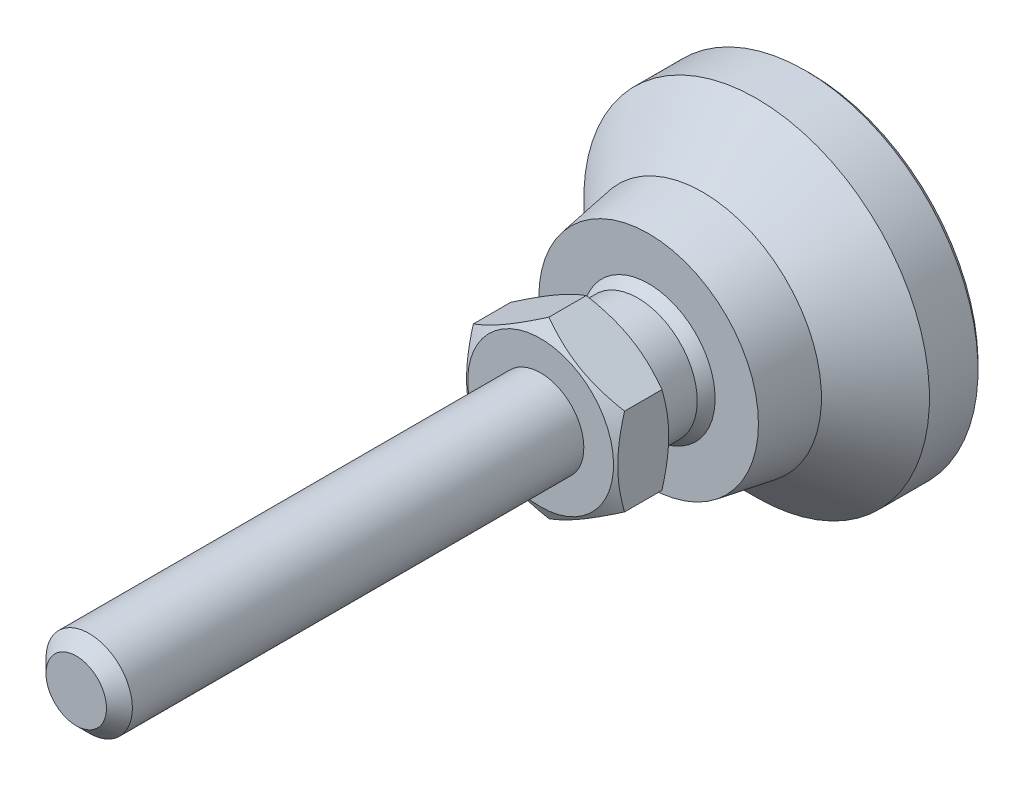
ISO-10303-21;
HEADER;
FILE_DESCRIPTION(('STEP AP214'),'2;1');
FILE_NAME('part.step','',(''),(''),'','','');
FILE_SCHEMA(('AUTOMOTIVE_DESIGN { 1 0 10303 214 1 1 1 1 }'));
ENDSEC;
DATA;
#1=APPLICATION_CONTEXT('core data for automotive mechanical design processes');
#2=APPLICATION_PROTOCOL_DEFINITION('international standard','automotive_design',2000,#1);
#3=PRODUCT_CONTEXT('',#1,'mechanical');
#4=PRODUCT('Part','Part','',(#3));
#5=PRODUCT_RELATED_PRODUCT_CATEGORY('part','',(#4));
#6=PRODUCT_DEFINITION_FORMATION('','',#4);
#7=PRODUCT_DEFINITION_CONTEXT('part definition',#1,'design');
#8=PRODUCT_DEFINITION('design','',#6,#7);
#9=PRODUCT_DEFINITION_SHAPE('','',#8);
#10=(LENGTH_UNIT() NAMED_UNIT(*) SI_UNIT(.MILLI.,.METRE.));
#11=(NAMED_UNIT(*) PLANE_ANGLE_UNIT() SI_UNIT($,.RADIAN.));
#12=(NAMED_UNIT(*) SI_UNIT($,.STERADIAN.) SOLID_ANGLE_UNIT());
#13=UNCERTAINTY_MEASURE_WITH_UNIT(LENGTH_MEASURE(1.E-05),#10,'distance_accuracy_value','');
#14=(GEOMETRIC_REPRESENTATION_CONTEXT(3) GLOBAL_UNCERTAINTY_ASSIGNED_CONTEXT((#13)) GLOBAL_UNIT_ASSIGNED_CONTEXT((#10,
#11,#12)) REPRESENTATION_CONTEXT('',''));
#15=CARTESIAN_POINT('',(0.,0.,0.));
#16=DIRECTION('',(0.,0.,1.));
#17=DIRECTION('',(1.,0.,0.));
#18=AXIS2_PLACEMENT_3D('',#15,#16,#17);
#19=CARTESIAN_POINT('',(0.,0.,0.));
#20=DIRECTION('',(0.,0.,-1.));
#21=DIRECTION('',(0.,1.,0.));
#22=AXIS2_PLACEMENT_3D('',#19,#20,#21);
#23=CYLINDRICAL_SURFACE('',#22,5.49999999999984);
#24=CARTESIAN_POINT('',(0.,0.,20.));
#25=DIRECTION('',(0.,0.,-1.));
#26=DIRECTION('',(0.,1.,0.));
#27=AXIS2_PLACEMENT_3D('',#24,#25,#26);
#28=CIRCLE('',#27,5.49999999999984);
#29=CARTESIAN_POINT('',(0.,5.49999999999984,20.));
#30=VERTEX_POINT('',#29);
#31=EDGE_CURVE('E111',#30,#30,#28,.T.);
#32=ORIENTED_EDGE('',*,*,#31,.T.);
#33=EDGE_LOOP('',(#32));
#34=FACE_BOUND('',#33,.T.);
#35=CARTESIAN_POINT('',(0.,0.,16.0000000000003));
#36=DIRECTION('',(0.,0.,1.));
#37=DIRECTION('',(0.,-1.,0.));
#38=AXIS2_PLACEMENT_3D('',#35,#36,#37);
#39=CIRCLE('',#38,5.49999999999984);
#40=CARTESIAN_POINT('',(-5.49999999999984,0.,16.0000000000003));
#41=VERTEX_POINT('',#40);
#42=EDGE_CURVE('E113',#41,#41,#39,.T.);
#43=ORIENTED_EDGE('',*,*,#42,.T.);
#44=EDGE_LOOP('',(#43));
#45=FACE_BOUND('',#44,.T.);
#46=ADVANCED_FACE('F14',(#34,#45),#23,.T.);
#47=CARTESIAN_POINT('',(0.,0.,11.6698729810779));
#48=DIRECTION('',(0.,0.,1.));
#49=DIRECTION('',(-1.,0.,0.));
#50=AXIS2_PLACEMENT_3D('',#47,#48,#49);
#51=SPHERICAL_SURFACE('',#50,7.);
#52=CARTESIAN_POINT('',(0.,0.,15.));
#53=DIRECTION('',(0.,0.,1.));
#54=DIRECTION('',(0.,-1.,0.));
#55=AXIS2_PLACEMENT_3D('',#52,#53,#54);
#56=CIRCLE('',#55,6.15713034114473);
#57=CARTESIAN_POINT('',(-6.15713034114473,0.,15.));
#58=VERTEX_POINT('',#57);
#59=EDGE_CURVE('E118',#58,#58,#56,.T.);
#60=CARTESIAN_POINT('',(-5.49999999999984,0.,16.0000000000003));
#61=CARTESIAN_POINT('',(-5.50771979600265,0.,15.9901945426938));
#62=CARTESIAN_POINT('',(-5.51541336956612,0.,15.9803684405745));
#63=CARTESIAN_POINT('',(-5.53074785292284,0.,15.9606752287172));
#64=CARTESIAN_POINT('',(-5.53838876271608,0.,15.9508081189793));
#65=CARTESIAN_POINT('',(-5.55361769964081,0.,15.9310331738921));
#66=CARTESIAN_POINT('',(-5.56120572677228,0.,15.9211253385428));
#67=CARTESIAN_POINT('',(-5.57632868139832,0.,15.9012692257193));
#68=CARTESIAN_POINT('',(-5.58386360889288,0.,15.8913209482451));
#69=CARTESIAN_POINT('',(-5.59888014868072,0.,15.871384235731));
#70=CARTESIAN_POINT('',(-5.60636176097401,0.,15.8613958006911));
#71=CARTESIAN_POINT('',(-5.62127145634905,0.,15.841379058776));
#72=CARTESIAN_POINT('',(-5.62869953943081,0.,15.8313507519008));
#73=CARTESIAN_POINT('',(-5.64350196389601,0.,15.81125455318));
#74=CARTESIAN_POINT('',(-5.65087630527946,0.,15.8011866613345));
#75=CARTESIAN_POINT('',(-5.66557103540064,0.,15.781011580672));
#76=CARTESIAN_POINT('',(-5.67289142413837,0.,15.770904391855));
#77=CARTESIAN_POINT('',(-5.68747803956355,0.,15.7506510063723));
#78=CARTESIAN_POINT('',(-5.69474426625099,0.,15.7405048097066));
#79=CARTESIAN_POINT('',(-5.70922234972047,0.,15.7201736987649));
#80=CARTESIAN_POINT('',(-5.7164342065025,0.,15.7099887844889));
#81=CARTESIAN_POINT('',(-5.7308033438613,0.,15.6895805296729));
#82=CARTESIAN_POINT('',(-5.73796062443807,0.,15.6793571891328));
#83=CARTESIAN_POINT('',(-5.75222040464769,0.,15.6588723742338));
#84=CARTESIAN_POINT('',(-5.75932290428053,0.,15.6486108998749));
#85=CARTESIAN_POINT('',(-5.77347291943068,0.,15.6280501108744));
#86=CARTESIAN_POINT('',(-5.78052043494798,0.,15.6177507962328));
#87=CARTESIAN_POINT('',(-5.79456028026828,0.,15.5971146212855));
#88=CARTESIAN_POINT('',(-5.80155261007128,0.,15.5867777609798));
#89=CARTESIAN_POINT('',(-5.81548188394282,0.,15.5660667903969));
#90=CARTESIAN_POINT('',(-5.82241882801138,0.,15.5556926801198));
#91=CARTESIAN_POINT('',(-5.83623713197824,0.,15.5349075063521));
#92=CARTESIAN_POINT('',(-5.84311849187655,0.,15.5244964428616));
#93=CARTESIAN_POINT('',(-5.85682543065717,0.,15.5036376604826));
#94=CARTESIAN_POINT('',(-5.86365100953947,0.,15.493189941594));
#95=CARTESIAN_POINT('',(-5.87724619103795,0.,15.4722581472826));
#96=CARTESIAN_POINT('',(-5.88401579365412,0.,15.4617740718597));
#97=CARTESIAN_POINT('',(-5.89749882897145,0.,15.4407698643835));
#98=CARTESIAN_POINT('',(-5.90421226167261,0.,15.4302497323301));
#99=CARTESIAN_POINT('',(-5.91758276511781,0.,15.4091737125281));
#100=CARTESIAN_POINT('',(-5.92423983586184,0.,15.3986178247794));
#101=CARTESIAN_POINT('',(-5.93749742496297,0.,15.3774705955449));
#102=CARTESIAN_POINT('',(-5.94409794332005,0.,15.366879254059));
#103=CARTESIAN_POINT('',(-5.95724223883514,0.,15.3456614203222));
#104=CARTESIAN_POINT('',(-5.96378601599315,0.,15.3350349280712));
#105=CARTESIAN_POINT('',(-5.9768166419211,0.,15.313747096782));
#106=CARTESIAN_POINT('',(-5.98330349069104,0.,15.3030857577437));
#107=CARTESIAN_POINT('',(-5.99622007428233,0.,15.2817285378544));
#108=CARTESIAN_POINT('',(-6.00264980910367,0.,15.2710326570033));
#109=CARTESIAN_POINT('',(-6.015451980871,0.,15.2496066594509));
#110=CARTESIAN_POINT('',(-6.02182441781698,0.,15.2388765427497));
#111=CARTESIAN_POINT('',(-6.034511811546,0.,15.217382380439));
#112=CARTESIAN_POINT('',(-6.04082676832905,0.,15.2066183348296));
#113=CARTESIAN_POINT('',(-6.05339902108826,0.,15.1850566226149));
#114=CARTESIAN_POINT('',(-6.05965631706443,0.,15.1742589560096));
#115=CARTESIAN_POINT('',(-6.07211306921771,0.,15.1526303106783));
#116=CARTESIAN_POINT('',(-6.07831252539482,0.,15.1417993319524));
#117=CARTESIAN_POINT('',(-6.09065342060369,0.,15.1201043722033));
#118=CARTESIAN_POINT('',(-6.09679485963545,0.,15.1092403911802));
#119=CARTESIAN_POINT('',(-6.10901954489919,0.,15.0874797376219));
#120=CARTESIAN_POINT('',(-6.11510279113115,0.,15.0765830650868));
#121=CARTESIAN_POINT('',(-6.12721091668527,0.,15.054757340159));
#122=CARTESIAN_POINT('',(-6.13323579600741,0.,15.0438282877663));
#123=CARTESIAN_POINT('',(-6.14522701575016,0.,15.0219381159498));
#124=CARTESIAN_POINT('',(-6.15119335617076,0.,15.010976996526));
#125=CARTESIAN_POINT('',(-6.15713034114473,0.,15.));
#126=B_SPLINE_CURVE_WITH_KNOTS('',3,(#60,#61,#62,#63,#64,#65,#66,#67,#68,#69,#70,#71,#72,#73,
#74,#75,#76,#77,#78,#79,#80,#81,#82,#83,#84,#85,#86,#87,#88,#89,#90,#91,#92,#93,#94,#95,#96,#97,
#98,#99,#100,#101,#102,#103,#104,#105,#106,#107,#108,#109,#110,#111,#112,#113,#114,#115,#116,
#117,#118,#119,#120,#121,#122,#123,#124,#125),.UNSPECIFIED.,.F.,.F.,(4,2,2,2,2,2,2,2,2,2,2,2,2,
2,2,2,2,2,2,2,2,2,2,2,2,2,2,2,2,2,2,2,4),(0.,0.0374389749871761,0.0748779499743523,
0.112316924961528,0.149755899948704,0.18719487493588,0.224633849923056,0.26207282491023,
0.299511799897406,0.336950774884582,0.374389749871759,0.411828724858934,0.449267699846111,
0.486706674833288,0.524145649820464,0.56158462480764,0.599023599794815,0.636462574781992,
0.673901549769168,0.711340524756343,0.74877949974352,0.786218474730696,0.823657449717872,
0.861096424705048,0.898535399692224,0.9359743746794,0.973413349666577,1.01085232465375,
1.04829129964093,1.0857302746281,1.12316924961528,1.16060822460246,1.19804719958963),.UNSPECIFIED.);
#127=EDGE_CURVE('BSEAM156',#41,#58,#126,.T.);
#128=ORIENTED_EDGE('',*,*,#42,.F.);
#129=ORIENTED_EDGE('',*,*,#59,.T.);
#130=ORIENTED_EDGE('',*,*,#127,.T.);
#131=ORIENTED_EDGE('',*,*,#127,.F.);
#132=EDGE_LOOP('',(#128,#130,#129,#131));
#133=FACE_BOUND('',#132,.T.);
#134=ADVANCED_FACE('F156',(#133),#51,.T.);
#135=CARTESIAN_POINT('',(-15.5,0.,0.));
#136=DIRECTION('',(0.,0.,1.));
#137=DIRECTION('',(0.,-1.,0.));
#138=AXIS2_PLACEMENT_3D('',#135,#136,#137);
#139=PLANE('',#138);
#140=CARTESIAN_POINT('',(0.,0.,0.));
#141=DIRECTION('',(0.,0.,-1.));
#142=DIRECTION('',(0.,1.,0.));
#143=AXIS2_PLACEMENT_3D('',#140,#141,#142);
#144=CIRCLE('',#143,15.5);
#145=CARTESIAN_POINT('',(0.,15.5,0.));
#146=VERTEX_POINT('',#145);
#147=EDGE_CURVE('E87',#146,#146,#144,.T.);
#148=ORIENTED_EDGE('',*,*,#147,.T.);
#149=EDGE_LOOP('',(#148));
#150=FACE_BOUND('',#149,.T.);
#151=ADVANCED_FACE('F161',(#150),#139,.F.);
#152=CARTESIAN_POINT('',(0.,0.,0.500000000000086));
#153=DIRECTION('',(0.,0.,1.));
#154=DIRECTION('',(0.,-1.,0.));
#155=AXIS2_PLACEMENT_3D('',#152,#153,#154);
#156=CONICAL_SURFACE('',#155,16.,0.785398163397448);
#157=ORIENTED_EDGE('',*,*,#147,.F.);
#158=EDGE_LOOP('',(#157));
#159=FACE_BOUND('',#158,.T.);
#160=CARTESIAN_POINT('',(0.,0.,0.500000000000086));
#161=DIRECTION('',(0.,0.,-1.));
#162=DIRECTION('',(0.,1.,0.));
#163=AXIS2_PLACEMENT_3D('',#160,#161,#162);
#164=CIRCLE('',#163,16.);
#165=CARTESIAN_POINT('',(0.,16.,0.500000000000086));
#166=VERTEX_POINT('',#165);
#167=EDGE_CURVE('E90',#166,#166,#164,.T.);
#168=ORIENTED_EDGE('',*,*,#167,.T.);
#169=EDGE_LOOP('',(#168));
#170=FACE_BOUND('',#169,.T.);
#171=ADVANCED_FACE('F171',(#159,#170),#156,.T.);
#172=CARTESIAN_POINT('',(0.,0.,0.));
#173=DIRECTION('',(0.,0.,-1.));
#174=DIRECTION('',(0.,1.,0.));
#175=AXIS2_PLACEMENT_3D('',#172,#173,#174);
#176=CYLINDRICAL_SURFACE('',#175,16.);
#177=ORIENTED_EDGE('',*,*,#167,.F.);
#178=EDGE_LOOP('',(#177));
#179=FACE_BOUND('',#178,.T.);
#180=CARTESIAN_POINT('',(0.,0.,5.00000000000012));
#181=DIRECTION('',(0.,0.,-1.));
#182=DIRECTION('',(0.,1.,0.));
#183=AXIS2_PLACEMENT_3D('',#180,#181,#182);
#184=CIRCLE('',#183,16.);
#185=CARTESIAN_POINT('',(0.,16.,5.00000000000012));
#186=VERTEX_POINT('',#185);
#187=EDGE_CURVE('E107',#186,#186,#184,.T.);
#188=ORIENTED_EDGE('',*,*,#187,.T.);
#189=EDGE_LOOP('',(#188));
#190=FACE_BOUND('',#189,.T.);
#191=ADVANCED_FACE('F167',(#179,#190),#176,.T.);
#192=CARTESIAN_POINT('',(0.,0.,10.));
#193=DIRECTION('',(0.,0.,-1.));
#194=DIRECTION('',(0.,1.,0.));
#195=AXIS2_PLACEMENT_3D('',#192,#193,#194);
#196=CONICAL_SURFACE('',#195,11.,0.785398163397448);
#197=ORIENTED_EDGE('',*,*,#187,.F.);
#198=EDGE_LOOP('',(#197));
#199=FACE_BOUND('',#198,.T.);
#200=CARTESIAN_POINT('',(0.,0.,10.));
#201=DIRECTION('',(0.,0.,-1.));
#202=DIRECTION('',(0.,1.,0.));
#203=AXIS2_PLACEMENT_3D('',#200,#201,#202);
#204=CIRCLE('',#203,11.);
#205=CARTESIAN_POINT('',(0.,11.,10.));
#206=VERTEX_POINT('',#205);
#207=EDGE_CURVE('E28',#206,#206,#204,.T.);
#208=ORIENTED_EDGE('',*,*,#207,.T.);
#209=EDGE_LOOP('',(#208));
#210=FACE_BOUND('',#209,.T.);
#211=ADVANCED_FACE('F150',(#199,#210),#196,.T.);
#212=CARTESIAN_POINT('',(0.,0.,16.));
#213=DIRECTION('',(0.,0.,-1.));
#214=DIRECTION('',(0.,1.,0.));
#215=AXIS2_PLACEMENT_3D('',#212,#213,#214);
#216=CONICAL_SURFACE('',#215,10.,0.165148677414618);
#217=ORIENTED_EDGE('',*,*,#207,.F.);
#218=EDGE_LOOP('',(#217));
#219=FACE_BOUND('',#218,.T.);
#220=CARTESIAN_POINT('',(0.,0.,15.));
#221=DIRECTION('',(0.,0.,-1.));
#222=DIRECTION('',(0.,1.,0.));
#223=AXIS2_PLACEMENT_3D('',#220,#221,#222);
#224=CIRCLE('',#223,10.1666666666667);
#225=CARTESIAN_POINT('',(0.,10.1666666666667,15.));
#226=VERTEX_POINT('',#225);
#227=EDGE_CURVE('E95',#226,#226,#224,.T.);
#228=ORIENTED_EDGE('',*,*,#227,.T.);
#229=EDGE_LOOP('',(#228));
#230=FACE_BOUND('',#229,.T.);
#231=ADVANCED_FACE('F135',(#219,#230),#216,.T.);
#232=CARTESIAN_POINT('',(-10.1666666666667,0.,15.));
#233=DIRECTION('',(0.,0.,1.));
#234=DIRECTION('',(0.,-1.,0.));
#235=AXIS2_PLACEMENT_3D('',#232,#233,#234);
#236=PLANE('',#235);
#237=ORIENTED_EDGE('',*,*,#227,.F.);
#238=EDGE_LOOP('',(#237));
#239=FACE_BOUND('',#238,.T.);
#240=ORIENTED_EDGE('',*,*,#59,.F.);
#241=EDGE_LOOP('',(#240));
#242=FACE_BOUND('',#241,.T.);
#243=ADVANCED_FACE('F137',(#239,#242),#236,.T.);
#244=CARTESIAN_POINT('',(0.,-8.08290376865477,20.));
#245=DIRECTION('',(0.,0.,-1.));
#246=DIRECTION('',(0.,1.,0.));
#247=AXIS2_PLACEMENT_3D('',#244,#245,#246);
#248=PLANE('',#247);
#249=CARTESIAN_POINT('',(0.,0.,20.));
#250=DIRECTION('',(0.,0.,1.));
#251=DIRECTION('',(0.,-1.,0.));
#252=AXIS2_PLACEMENT_3D('',#249,#250,#251);
#253=CIRCLE('',#252,6.75);
#254=CARTESIAN_POINT('',(0.,-6.75,20.));
#255=VERTEX_POINT('',#254);
#256=EDGE_CURVE('E81',#255,#255,#253,.T.);
#257=ORIENTED_EDGE('',*,*,#256,.F.);
#258=EDGE_LOOP('',(#257));
#259=FACE_BOUND('',#258,.T.);
#260=ORIENTED_EDGE('',*,*,#31,.F.);
#261=EDGE_LOOP('',(#260));
#262=FACE_BOUND('',#261,.T.);
#263=ADVANCED_FACE('F140',(#259,#262),#248,.T.);
#264=CARTESIAN_POINT('',(0.,0.,20.));
#265=DIRECTION('',(0.,0.,1.));
#266=DIRECTION('',(0.,-1.,0.));
#267=AXIS2_PLACEMENT_3D('',#264,#265,#266);
#268=CONICAL_SURFACE('',#267,6.75,1.0471975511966);
#269=CARTESIAN_POINT('',(7.0002,-4.04133641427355,20.7696190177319));
#270=CARTESIAN_POINT('',(6.84633209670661,-4.13017208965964,20.7183374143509));
#271=CARTESIAN_POINT('',(6.69189049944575,-4.21933898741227,20.669383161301));
#272=CARTESIAN_POINT('',(6.38175307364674,-4.3983969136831,20.5767703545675));
#273=CARTESIAN_POINT('',(6.22605673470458,-4.4882882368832,20.5331140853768));
#274=CARTESIAN_POINT('',(5.75647483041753,-4.7594014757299,20.4109491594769));
#275=CARTESIAN_POINT('',(5.4407356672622,-4.94169356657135,20.3414631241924));
#276=CARTESIAN_POINT('',(4.96823775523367,-5.21449036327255,20.2599825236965));
#277=CARTESIAN_POINT('',(4.81289077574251,-5.30417998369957,20.2367710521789));
#278=CARTESIAN_POINT('',(4.50149488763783,-5.48396448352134,20.1978487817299));
#279=CARTESIAN_POINT('',(4.34544604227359,-5.57405932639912,20.1821373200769));
#280=CARTESIAN_POINT('',(4.03307732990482,-5.75440548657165,20.1586154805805));
#281=CARTESIAN_POINT('',(3.87675797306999,-5.84465650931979,20.1507961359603));
#282=CARTESIAN_POINT('',(3.56398349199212,-6.02523694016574,20.1432178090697));
#283=CARTESIAN_POINT('',(3.40752837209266,-6.11556634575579,20.1434585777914));
#284=CARTESIAN_POINT('',(2.97889312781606,-6.36303901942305,20.155197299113));
#285=CARTESIAN_POINT('',(2.7068533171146,-6.52010127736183,20.1749033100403));
#286=CARTESIAN_POINT('',(2.1645805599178,-6.8331825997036,20.2373910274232));
#287=CARTESIAN_POINT('',(1.89434952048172,-6.98920056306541,20.2801940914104));
#288=CARTESIAN_POINT('',(1.35098545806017,-7.30291195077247,20.3871892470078));
#289=CARTESIAN_POINT('',(1.07792099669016,-7.46056579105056,20.4518346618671));
#290=CARTESIAN_POINT('',(0.535864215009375,-7.77352241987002,20.5985536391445));
#291=CARTESIAN_POINT('',(0.266864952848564,-7.92882921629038,20.680592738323));
#292=CARTESIAN_POINT('',(-0.000199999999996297,-8.08301923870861,20.7696190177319));
#293=B_SPLINE_CURVE_WITH_KNOTS('',3,(#269,#270,#271,#272,#273,#274,#275,#276,#277,#278,#279,
#280,#281,#282,#283,#284,#285,#286,#287,#288,#289,#290,#291,#292),.UNSPECIFIED.,.F.,.F.,(4,2,2,
2,2,2,2,2,2,2,2,4),(0.,0.554727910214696,1.10969417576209,2.2219327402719,2.76443041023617,
3.30688013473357,3.8487128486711,4.39052882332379,5.33376515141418,6.27787517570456,
7.24292418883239,8.20607866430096),.UNSPECIFIED.);
#294=CARTESIAN_POINT('',(7.,-4.04145188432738,20.7695523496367));
#295=VERTEX_POINT('',#294);
#296=CARTESIAN_POINT('',(0.,-8.08290376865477,20.7695523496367));
#297=VERTEX_POINT('',#296);
#298=EDGE_CURVE('E34',#295,#297,#293,.T.);
#299=ORIENTED_EDGE('',*,*,#298,.T.);
#300=CARTESIAN_POINT('',(0.000200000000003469,-8.0830192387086,20.7696190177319));
#301=CARTESIAN_POINT('',(-0.153667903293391,-7.99418356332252,20.7183374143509));
#302=CARTESIAN_POINT('',(-0.30810950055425,-7.90501666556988,20.669383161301));
#303=CARTESIAN_POINT('',(-0.618246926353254,-7.72595873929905,20.5767703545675));
#304=CARTESIAN_POINT('',(-0.773943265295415,-7.63606741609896,20.5331140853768));
#305=CARTESIAN_POINT('',(-1.24352516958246,-7.36495417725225,20.4109491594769));
#306=CARTESIAN_POINT('',(-1.5592643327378,-7.18266208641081,20.3414631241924));
#307=CARTESIAN_POINT('',(-2.03176224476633,-6.90986528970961,20.2599825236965));
#308=CARTESIAN_POINT('',(-2.18710922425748,-6.82017566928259,20.2367710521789));
#309=CARTESIAN_POINT('',(-2.49850511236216,-6.64039116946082,20.1978487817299));
#310=CARTESIAN_POINT('',(-2.65455395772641,-6.55029632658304,20.1821373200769));
#311=CARTESIAN_POINT('',(-2.96692267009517,-6.36995016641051,20.1586154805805));
#312=CARTESIAN_POINT('',(-3.12324202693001,-6.27969914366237,20.1507961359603));
#313=CARTESIAN_POINT('',(-3.43601650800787,-6.09911871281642,20.1432178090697));
#314=CARTESIAN_POINT('',(-3.59247162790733,-6.00878930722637,20.1434585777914));
#315=CARTESIAN_POINT('',(-4.02110687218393,-5.76131663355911,20.155197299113));
#316=CARTESIAN_POINT('',(-4.29314668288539,-5.60425437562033,20.1749033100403));
#317=CARTESIAN_POINT('',(-4.83541944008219,-5.29117305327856,20.2373910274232));
#318=CARTESIAN_POINT('',(-5.10565047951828,-5.13515508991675,20.2801940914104));
#319=CARTESIAN_POINT('',(-5.64901454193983,-4.82144370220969,20.3871892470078));
#320=CARTESIAN_POINT('',(-5.92207900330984,-4.6637898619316,20.4518346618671));
#321=CARTESIAN_POINT('',(-6.46413578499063,-4.35083323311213,20.5985536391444));
#322=CARTESIAN_POINT('',(-6.73313504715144,-4.19552643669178,20.680592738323));
#323=CARTESIAN_POINT('',(-7.0002,-4.04133641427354,20.7696190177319));
#324=B_SPLINE_CURVE_WITH_KNOTS('',3,(#300,#301,#302,#303,#304,#305,#306,#307,#308,#309,#310,
#311,#312,#313,#314,#315,#316,#317,#318,#319,#320,#321,#322,#323),.UNSPECIFIED.,.F.,.F.,(4,2,2,
2,2,2,2,2,2,2,2,4),(0.,0.554727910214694,1.10969417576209,2.2219327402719,2.76443041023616,
3.30688013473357,3.84871284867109,4.39052882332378,5.33376515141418,6.27787517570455,
7.2429241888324,8.20607866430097),.UNSPECIFIED.);
#325=CARTESIAN_POINT('',(-7.,-4.04145188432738,20.7695523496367));
#326=VERTEX_POINT('',#325);
#327=EDGE_CURVE('E9',#297,#326,#324,.T.);
#328=ORIENTED_EDGE('',*,*,#327,.T.);
#329=CARTESIAN_POINT('',(-7.,10.8824942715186,23.5734653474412));
#330=CARTESIAN_POINT('',(-7.,10.5765329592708,23.4249396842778));
#331=CARTESIAN_POINT('',(-7.,10.2698721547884,23.2778304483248));
#332=CARTESIAN_POINT('',(-7.,9.65477966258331,22.9872409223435));
#333=CARTESIAN_POINT('',(-7.,9.3463477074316,22.8437611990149));
#334=CARTESIAN_POINT('',(-7.,8.7257646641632,22.560510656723));
#335=CARTESIAN_POINT('',(-7.,8.41360248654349,22.420764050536));
#336=CARTESIAN_POINT('',(-7.,7.78680467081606,22.146954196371));
#337=CARTESIAN_POINT('',(-7.,7.47216914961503,22.0128906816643));
#338=CARTESIAN_POINT('',(-7.,6.82966700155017,21.7477132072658));
#339=CARTESIAN_POINT('',(-7.,6.50170217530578,21.6168358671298));
#340=CARTESIAN_POINT('',(-7.,5.84194621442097,21.3649220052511));
#341=CARTESIAN_POINT('',(-7.,5.51015465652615,21.2438865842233));
#342=CARTESIAN_POINT('',(-7.,4.84282577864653,21.0148147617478));
#343=CARTESIAN_POINT('',(-7.,4.50729750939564,20.9067522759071));
#344=CARTESIAN_POINT('',(-7.,3.83143993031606,20.7070748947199));
#345=CARTESIAN_POINT('',(-7.,3.49111216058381,20.615454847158));
#346=CARTESIAN_POINT('',(-7.,2.80729981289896,20.4535361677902));
#347=CARTESIAN_POINT('',(-7.,2.46384360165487,20.3831209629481));
#348=CARTESIAN_POINT('',(-7.,1.94550999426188,20.2964366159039));
#349=CARTESIAN_POINT('',(-7.,1.77219452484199,20.270697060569));
#350=CARTESIAN_POINT('',(-7.,1.4246938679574,20.2260351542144));
#351=CARTESIAN_POINT('',(-7.,1.25050877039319,20.2071121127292));
#352=CARTESIAN_POINT('',(-7.,0.903788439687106,20.1766987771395));
#353=CARTESIAN_POINT('',(-7.,0.731261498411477,20.1651143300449));
#354=CARTESIAN_POINT('',(-7.,0.385872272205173,20.1492530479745));
#355=CARTESIAN_POINT('',(-7.,0.213009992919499,20.1449760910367));
#356=CARTESIAN_POINT('',(-7.,-0.132740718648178,20.1438318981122));
#357=CARTESIAN_POINT('',(-7.,-0.30562915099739,20.146964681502));
#358=CARTESIAN_POINT('',(-7.,-0.651119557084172,20.1605630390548));
#359=CARTESIAN_POINT('',(-7.,-0.823721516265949,20.1710289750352));
#360=CARTESIAN_POINT('',(-7.,-1.23772504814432,20.2047052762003));
#361=CARTESIAN_POINT('',(-7.,-1.47885323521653,20.231349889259));
#362=CARTESIAN_POINT('',(-7.,-1.95932615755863,20.2975033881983));
#363=CARTESIAN_POINT('',(-7.,-2.19867064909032,20.3370140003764));
#364=CARTESIAN_POINT('',(-7.,-2.91375123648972,20.4727503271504));
#365=CARTESIAN_POINT('',(-7.,-3.38626970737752,20.5861561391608));
#366=CARTESIAN_POINT('',(-7.,-4.09285227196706,20.7828982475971));
#367=CARTESIAN_POINT('',(-7.,-4.33057894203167,20.8538379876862));
#368=CARTESIAN_POINT('',(-7.,-4.80372351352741,21.0031074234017));
#369=CARTESIAN_POINT('',(-7.,-5.0391413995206,21.0814371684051));
#370=CARTESIAN_POINT('',(-7.,-5.50774208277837,21.2442279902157));
#371=CARTESIAN_POINT('',(-7.,-5.74092558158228,21.3286870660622));
#372=CARTESIAN_POINT('',(-7.,-6.20535901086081,21.5027406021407));
#373=CARTESIAN_POINT('',(-7.,-6.43660896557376,21.592334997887));
#374=CARTESIAN_POINT('',(-7.,-6.98862785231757,21.8121352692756));
#375=CARTESIAN_POINT('',(-7.,-7.30858573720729,21.9443744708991));
#376=CARTESIAN_POINT('',(-7.,-7.9457279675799,22.2153932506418));
#377=CARTESIAN_POINT('',(-7.,-8.26291213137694,22.3541732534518));
#378=CARTESIAN_POINT('',(-7.,-8.89502671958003,22.6369395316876));
#379=CARTESIAN_POINT('',(-7.,-9.20995664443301,22.7809269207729));
#380=CARTESIAN_POINT('',(-7.,-9.83789055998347,23.0730492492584));
#381=CARTESIAN_POINT('',(-7.,-10.1508945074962,23.2211842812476));
#382=CARTESIAN_POINT('',(-7.,-10.7756388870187,23.5209759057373));
#383=CARTESIAN_POINT('',(-7.,-11.0873775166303,23.6726362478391));
#384=CARTESIAN_POINT('',(-7.,-11.7095001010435,23.978713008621));
#385=CARTESIAN_POINT('',(-7.,-12.0198840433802,24.1331294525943));
#386=CARTESIAN_POINT('',(-7.,-12.9492447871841,24.5997261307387));
#387=CARTESIAN_POINT('',(-7.,-13.5665192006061,24.9152966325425));
#388=CARTESIAN_POINT('',(-7.,-14.7449495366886,25.5254104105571));
#389=CARTESIAN_POINT('',(-7.,-15.3063756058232,25.8194342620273));
#390=CARTESIAN_POINT('',(-7.,-16.4271514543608,26.4114608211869));
#391=CARTESIAN_POINT('',(-7.,-16.9865011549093,26.709463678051));
#392=CARTESIAN_POINT('',(-7.,-18.1021399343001,27.3077170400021));
#393=CARTESIAN_POINT('',(-7.,-18.658433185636,27.6079597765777));
#394=CARTESIAN_POINT('',(-7.,-19.7696960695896,28.2108102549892));
#395=CARTESIAN_POINT('',(-7.,-20.3246657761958,28.5134178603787));
#396=CARTESIAN_POINT('',(-7.,-20.8791503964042,28.8169057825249));
#397=B_SPLINE_CURVE_WITH_KNOTS('',3,(#329,#330,#331,#332,#333,#334,#335,#336,#337,#338,#339,
#340,#341,#342,#343,#344,#345,#346,#347,#348,#349,#350,#351,#352,#353,#354,#355,#356,#357,#358,
#359,#360,#361,#362,#363,#364,#365,#366,#367,#368,#369,#370,#371,#372,#373,#374,#375,#376,#377,
#378,#379,#380,#381,#382,#383,#384,#385,#386,#387,#388,#389,#390,#391,#392,#393,#394,#395,#396),
.UNSPECIFIED.,.F.,.F.,(4,2,2,2,2,2,2,2,2,2,2,2,2,2,2,2,2,2,2,2,2,2,2,2,2,2,2,2,2,2,2,2,2,4),(0.,
1.02033079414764,2.0408199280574,3.06681986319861,4.09277159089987,5.15199231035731,
6.21133133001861,7.26850335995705,8.32534354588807,9.37626301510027,9.90179919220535,
10.4272821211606,10.945878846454,11.464466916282,11.9830563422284,12.5016713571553,
13.2290483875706,13.9565230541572,15.4122663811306,16.1564603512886,16.9006592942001,
17.6446163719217,18.3885641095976,19.4270902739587,20.4656839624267,21.5045010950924,
22.5433414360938,23.5833424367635,24.6233529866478,26.7030785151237,28.6043357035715,
30.5056643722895,32.4020946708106,34.2984163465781),.UNSPECIFIED.);
#398=CARTESIAN_POINT('',(-7.,4.04145188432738,20.7695523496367));
#399=VERTEX_POINT('',#398);
#400=EDGE_CURVE('E73',#326,#399,#397,.F.);
#401=ORIENTED_EDGE('',*,*,#400,.T.);
#402=CARTESIAN_POINT('',(-7.0002,4.04133641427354,20.7696190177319));
#403=CARTESIAN_POINT('',(-6.84633209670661,4.13017208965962,20.7183374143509));
#404=CARTESIAN_POINT('',(-6.69189049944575,4.21933898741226,20.669383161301));
#405=CARTESIAN_POINT('',(-6.38175307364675,4.39839691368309,20.5767703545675));
#406=CARTESIAN_POINT('',(-6.22605673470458,4.48828823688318,20.5331140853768));
#407=CARTESIAN_POINT('',(-5.75647483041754,4.75940147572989,20.4109491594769));
#408=CARTESIAN_POINT('',(-5.4407356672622,4.94169356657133,20.3414631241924));
#409=CARTESIAN_POINT('',(-4.96823775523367,5.21449036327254,20.2599825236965));
#410=CARTESIAN_POINT('',(-4.81289077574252,5.30417998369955,20.2367710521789));
#411=CARTESIAN_POINT('',(-4.50149488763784,5.48396448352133,20.1978487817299));
#412=CARTESIAN_POINT('',(-4.34544604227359,5.57405932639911,20.1821373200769));
#413=CARTESIAN_POINT('',(-4.03307732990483,5.75440548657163,20.1586154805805));
#414=CARTESIAN_POINT('',(-3.87675797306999,5.84465650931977,20.1507961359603));
#415=CARTESIAN_POINT('',(-3.56398349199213,6.02523694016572,20.1432178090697));
#416=CARTESIAN_POINT('',(-3.40752837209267,6.11556634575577,20.1434585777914));
#417=CARTESIAN_POINT('',(-2.97889312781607,6.36303901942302,20.155197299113));
#418=CARTESIAN_POINT('',(-2.7068533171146,6.52010127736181,20.1749033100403));
#419=CARTESIAN_POINT('',(-2.16458055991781,6.83318259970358,20.2373910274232));
#420=CARTESIAN_POINT('',(-1.89434952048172,6.9892005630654,20.2801940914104));
#421=CARTESIAN_POINT('',(-1.35098545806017,7.30291195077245,20.3871892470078));
#422=CARTESIAN_POINT('',(-1.07792099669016,7.46056579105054,20.4518346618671));
#423=CARTESIAN_POINT('',(-0.535864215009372,7.77352241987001,20.5985536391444));
#424=CARTESIAN_POINT('',(-0.266864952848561,7.92882921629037,20.680592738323));
#425=CARTESIAN_POINT('',(0.000199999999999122,8.0830192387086,20.7696190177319));
#426=B_SPLINE_CURVE_WITH_KNOTS('',3,(#402,#403,#404,#405,#406,#407,#408,#409,#410,#411,#412,
#413,#414,#415,#416,#417,#418,#419,#420,#421,#422,#423,#424,#425),.UNSPECIFIED.,.F.,.F.,(4,2,2,
2,2,2,2,2,2,2,2,4),(0.,0.554727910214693,1.10969417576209,2.2219327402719,2.76443041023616,
3.30688013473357,3.84871284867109,4.39052882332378,5.33376515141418,6.27787517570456,
7.2429241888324,8.20607866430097),.UNSPECIFIED.);
#427=CARTESIAN_POINT('',(0.,8.08290376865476,20.7695523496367));
#428=VERTEX_POINT('',#427);
#429=EDGE_CURVE('E80',#399,#428,#426,.T.);
#430=ORIENTED_EDGE('',*,*,#429,.T.);
#431=CARTESIAN_POINT('',(-0.000200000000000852,8.0830192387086,20.7696190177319));
#432=CARTESIAN_POINT('',(0.153667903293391,7.99418356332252,20.7183374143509));
#433=CARTESIAN_POINT('',(0.308109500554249,7.90501666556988,20.669383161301));
#434=CARTESIAN_POINT('',(0.618246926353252,7.72595873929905,20.5767703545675));
#435=CARTESIAN_POINT('',(0.773943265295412,7.63606741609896,20.5331140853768));
#436=CARTESIAN_POINT('',(1.24352516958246,7.36495417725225,20.4109491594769));
#437=CARTESIAN_POINT('',(1.5592643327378,7.18266208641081,20.3414631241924));
#438=CARTESIAN_POINT('',(2.03176224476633,6.9098652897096,20.2599825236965));
#439=CARTESIAN_POINT('',(2.18710922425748,6.82017566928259,20.2367710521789));
#440=CARTESIAN_POINT('',(2.49850511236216,6.64039116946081,20.1978487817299));
#441=CARTESIAN_POINT('',(2.6545539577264,6.55029632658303,20.1821373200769));
#442=CARTESIAN_POINT('',(2.96692267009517,6.36995016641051,20.1586154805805));
#443=CARTESIAN_POINT('',(3.12324202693,6.27969914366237,20.1507961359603));
#444=CARTESIAN_POINT('',(3.43601650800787,6.09911871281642,20.1432178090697));
#445=CARTESIAN_POINT('',(3.59247162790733,6.00878930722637,20.1434585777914));
#446=CARTESIAN_POINT('',(4.02110687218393,5.76131663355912,20.155197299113));
#447=CARTESIAN_POINT('',(4.29314668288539,5.60425437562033,20.1749033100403));
#448=CARTESIAN_POINT('',(4.83541944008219,5.29117305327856,20.2373910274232));
#449=CARTESIAN_POINT('',(5.10565047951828,5.13515508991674,20.2801940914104));
#450=CARTESIAN_POINT('',(5.64901454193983,4.82144370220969,20.3871892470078));
#451=CARTESIAN_POINT('',(5.92207900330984,4.66378986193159,20.4518346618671));
#452=CARTESIAN_POINT('',(6.46413578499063,4.35083323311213,20.5985536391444));
#453=CARTESIAN_POINT('',(6.73313504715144,4.19552643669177,20.680592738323));
#454=CARTESIAN_POINT('',(7.0002,4.04133641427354,20.7696190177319));
#455=B_SPLINE_CURVE_WITH_KNOTS('',3,(#431,#432,#433,#434,#435,#436,#437,#438,#439,#440,#441,
#442,#443,#444,#445,#446,#447,#448,#449,#450,#451,#452,#453,#454),.UNSPECIFIED.,.F.,.F.,(4,2,2,
2,2,2,2,2,2,2,2,4),(0.,0.554727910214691,1.10969417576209,2.2219327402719,2.76443041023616,
3.30688013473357,3.84871284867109,4.39052882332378,5.33376515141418,6.27787517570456,
7.2429241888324,8.20607866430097),.UNSPECIFIED.);
#456=CARTESIAN_POINT('',(7.,4.04145188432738,20.7695523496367));
#457=VERTEX_POINT('',#456);
#458=EDGE_CURVE('E255',#428,#457,#455,.T.);
#459=ORIENTED_EDGE('',*,*,#458,.T.);
#460=CARTESIAN_POINT('',(7.,10.8824942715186,23.5734653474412));
#461=CARTESIAN_POINT('',(7.,10.5765329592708,23.4249396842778));
#462=CARTESIAN_POINT('',(7.,10.2698721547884,23.2778304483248));
#463=CARTESIAN_POINT('',(7.,9.65477966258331,22.9872409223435));
#464=CARTESIAN_POINT('',(7.,9.34634770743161,22.8437611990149));
#465=CARTESIAN_POINT('',(7.,8.7257646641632,22.560510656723));
#466=CARTESIAN_POINT('',(7.,8.4136024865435,22.420764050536));
#467=CARTESIAN_POINT('',(7.,7.78680467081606,22.146954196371));
#468=CARTESIAN_POINT('',(7.,7.47216914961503,22.0128906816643));
#469=CARTESIAN_POINT('',(7.,6.82966700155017,21.7477132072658));
#470=CARTESIAN_POINT('',(7.,6.50170217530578,21.6168358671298));
#471=CARTESIAN_POINT('',(7.,5.84194621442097,21.3649220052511));
#472=CARTESIAN_POINT('',(7.,5.51015465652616,21.2438865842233));
#473=CARTESIAN_POINT('',(7.,4.84282577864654,21.0148147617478));
#474=CARTESIAN_POINT('',(7.,4.50729750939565,20.9067522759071));
#475=CARTESIAN_POINT('',(7.,3.83143993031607,20.7070748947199));
#476=CARTESIAN_POINT('',(7.,3.49111216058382,20.615454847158));
#477=CARTESIAN_POINT('',(7.,2.80729981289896,20.4535361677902));
#478=CARTESIAN_POINT('',(7.,2.46384360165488,20.3831209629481));
#479=CARTESIAN_POINT('',(7.,1.94550999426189,20.2964366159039));
#480=CARTESIAN_POINT('',(7.,1.77219452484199,20.270697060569));
#481=CARTESIAN_POINT('',(7.,1.42469386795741,20.2260351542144));
#482=CARTESIAN_POINT('',(7.,1.25050877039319,20.2071121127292));
#483=CARTESIAN_POINT('',(7.,0.903788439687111,20.1766987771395));
#484=CARTESIAN_POINT('',(7.,0.731261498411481,20.1651143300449));
#485=CARTESIAN_POINT('',(7.,0.385872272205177,20.1492530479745));
#486=CARTESIAN_POINT('',(7.,0.213009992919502,20.1449760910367));
#487=CARTESIAN_POINT('',(7.,-0.132740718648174,20.1438318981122));
#488=CARTESIAN_POINT('',(7.,-0.305629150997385,20.146964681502));
#489=CARTESIAN_POINT('',(7.,-0.651119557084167,20.1605630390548));
#490=CARTESIAN_POINT('',(7.,-0.823721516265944,20.1710289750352));
#491=CARTESIAN_POINT('',(7.,-1.23772504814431,20.2047052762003));
#492=CARTESIAN_POINT('',(7.,-1.47885323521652,20.231349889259));
#493=CARTESIAN_POINT('',(7.,-1.95932615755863,20.2975033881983));
#494=CARTESIAN_POINT('',(7.,-2.19867064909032,20.3370140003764));
#495=CARTESIAN_POINT('',(7.,-2.91375123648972,20.4727503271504));
#496=CARTESIAN_POINT('',(7.,-3.38626970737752,20.5861561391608));
#497=CARTESIAN_POINT('',(7.,-4.09285227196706,20.7828982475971));
#498=CARTESIAN_POINT('',(7.,-4.33057894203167,20.8538379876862));
#499=CARTESIAN_POINT('',(7.,-4.80372351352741,21.0031074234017));
#500=CARTESIAN_POINT('',(7.,-5.0391413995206,21.0814371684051));
#501=CARTESIAN_POINT('',(7.,-5.50774208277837,21.2442279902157));
#502=CARTESIAN_POINT('',(7.,-5.74092558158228,21.3286870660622));
#503=CARTESIAN_POINT('',(7.,-6.20535901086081,21.5027406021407));
#504=CARTESIAN_POINT('',(7.,-6.43660896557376,21.592334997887));
#505=CARTESIAN_POINT('',(7.,-6.98862785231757,21.8121352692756));
#506=CARTESIAN_POINT('',(7.,-7.30858573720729,21.9443744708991));
#507=CARTESIAN_POINT('',(7.,-7.9457279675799,22.2153932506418));
#508=CARTESIAN_POINT('',(7.,-8.26291213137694,22.3541732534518));
#509=CARTESIAN_POINT('',(7.,-8.89502671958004,22.6369395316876));
#510=CARTESIAN_POINT('',(7.,-9.20995664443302,22.7809269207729));
#511=CARTESIAN_POINT('',(7.,-9.83789055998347,23.0730492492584));
#512=CARTESIAN_POINT('',(7.,-10.1508945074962,23.2211842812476));
#513=CARTESIAN_POINT('',(7.,-10.7756388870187,23.5209759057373));
#514=CARTESIAN_POINT('',(7.,-11.0873775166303,23.6726362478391));
#515=CARTESIAN_POINT('',(7.,-11.7095001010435,23.978713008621));
#516=CARTESIAN_POINT('',(7.,-12.0198840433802,24.1331294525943));
#517=CARTESIAN_POINT('',(7.,-12.9492447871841,24.5997261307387));
#518=CARTESIAN_POINT('',(7.,-13.5665192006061,24.9152966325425));
#519=CARTESIAN_POINT('',(7.,-14.7449495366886,25.5254104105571));
#520=CARTESIAN_POINT('',(7.,-15.3063756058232,25.8194342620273));
#521=CARTESIAN_POINT('',(7.,-16.4271514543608,26.4114608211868));
#522=CARTESIAN_POINT('',(7.,-16.9865011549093,26.709463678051));
#523=CARTESIAN_POINT('',(7.,-18.1021399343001,27.3077170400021));
#524=CARTESIAN_POINT('',(7.,-18.658433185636,27.6079597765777));
#525=CARTESIAN_POINT('',(7.,-19.7696960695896,28.2108102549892));
#526=CARTESIAN_POINT('',(7.,-20.3246657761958,28.5134178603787));
#527=CARTESIAN_POINT('',(7.,-20.8791503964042,28.8169057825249));
#528=B_SPLINE_CURVE_WITH_KNOTS('',3,(#460,#461,#462,#463,#464,#465,#466,#467,#468,#469,#470,
#471,#472,#473,#474,#475,#476,#477,#478,#479,#480,#481,#482,#483,#484,#485,#486,#487,#488,#489,
#490,#491,#492,#493,#494,#495,#496,#497,#498,#499,#500,#501,#502,#503,#504,#505,#506,#507,#508,
#509,#510,#511,#512,#513,#514,#515,#516,#517,#518,#519,#520,#521,#522,#523,#524,#525,#526,#527),
.UNSPECIFIED.,.F.,.F.,(4,2,2,2,2,2,2,2,2,2,2,2,2,2,2,2,2,2,2,2,2,2,2,2,2,2,2,2,2,2,2,2,2,4),(0.,
1.02033079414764,2.0408199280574,3.06681986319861,4.09277159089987,5.15199231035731,
6.21133133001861,7.26850335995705,8.32534354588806,9.37626301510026,9.90179919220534,
10.4272821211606,10.945878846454,11.464466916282,11.9830563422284,12.5016713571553,
13.2290483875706,13.9565230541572,15.4122663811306,16.1564603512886,16.9006592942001,
17.6446163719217,18.3885641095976,19.4270902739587,20.4656839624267,21.5045010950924,
22.5433414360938,23.5833424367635,24.6233529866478,26.7030785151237,28.6043357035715,
30.5056643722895,32.4020946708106,34.2984163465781),.UNSPECIFIED.);
#529=EDGE_CURVE('E249',#457,#295,#528,.T.);
#530=ORIENTED_EDGE('',*,*,#529,.T.);
#531=EDGE_LOOP('',(#299,#328,#401,#430,#459,#530));
#532=FACE_BOUND('',#531,.T.);
#533=ORIENTED_EDGE('',*,*,#256,.T.);
#534=EDGE_LOOP('',(#533));
#535=FACE_BOUND('',#534,.T.);
#536=ADVANCED_FACE('F71',(#532,#535),#268,.T.);
#537=CARTESIAN_POINT('',(0.,0.,68.));
#538=DIRECTION('',(0.,0.,-1.));
#539=DIRECTION('',(0.,1.,0.));
#540=AXIS2_PLACEMENT_3D('',#537,#538,#539);
#541=PLANE('',#540);
#542=CARTESIAN_POINT('',(0.,0.,68.));
#543=DIRECTION('',(0.,0.,1.));
#544=DIRECTION('',(0.,-1.,0.));
#545=AXIS2_PLACEMENT_3D('',#542,#543,#544);
#546=CIRCLE('',#545,2.79999999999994);
#547=CARTESIAN_POINT('',(0.,-2.79999999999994,68.));
#548=VERTEX_POINT('',#547);
#549=EDGE_CURVE('E121',#548,#548,#546,.T.);
#550=ORIENTED_EDGE('',*,*,#549,.T.);
#551=EDGE_LOOP('',(#550));
#552=FACE_BOUND('',#551,.T.);
#553=ADVANCED_FACE('F277',(#552),#541,.F.);
#554=CARTESIAN_POINT('',(0.,0.,66.8));
#555=DIRECTION('',(0.,0.,-1.));
#556=DIRECTION('',(0.,1.,0.));
#557=AXIS2_PLACEMENT_3D('',#554,#555,#556);
#558=CONICAL_SURFACE('',#557,3.99999999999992,0.785398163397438);
#559=ORIENTED_EDGE('',*,*,#549,.F.);
#560=EDGE_LOOP('',(#559));
#561=FACE_BOUND('',#560,.T.);
#562=CARTESIAN_POINT('',(0.,0.,66.8));
#563=DIRECTION('',(0.,0.,1.));
#564=DIRECTION('',(0.,-1.,0.));
#565=AXIS2_PLACEMENT_3D('',#562,#563,#564);
#566=CIRCLE('',#565,3.99999999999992);
#567=CARTESIAN_POINT('',(0.,-3.99999999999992,66.8));
#568=VERTEX_POINT('',#567);
#569=EDGE_CURVE('E126',#568,#568,#566,.T.);
#570=ORIENTED_EDGE('',*,*,#569,.T.);
#571=EDGE_LOOP('',(#570));
#572=FACE_BOUND('',#571,.T.);
#573=ADVANCED_FACE('F208',(#561,#572),#558,.T.);
#574=CARTESIAN_POINT('',(0.,0.,0.));
#575=DIRECTION('',(0.,0.,-1.));
#576=DIRECTION('',(0.,1.,0.));
#577=AXIS2_PLACEMENT_3D('',#574,#575,#576);
#578=CYLINDRICAL_SURFACE('',#577,3.99999999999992);
#579=ORIENTED_EDGE('',*,*,#569,.F.);
#580=EDGE_LOOP('',(#579));
#581=FACE_BOUND('',#580,.T.);
#582=CARTESIAN_POINT('',(0.,0.,25.));
#583=DIRECTION('',(0.,0.,1.));
#584=DIRECTION('',(0.,-1.,0.));
#585=AXIS2_PLACEMENT_3D('',#582,#583,#584);
#586=CIRCLE('',#585,3.99999999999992);
#587=CARTESIAN_POINT('',(0.,-3.99999999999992,25.));
#588=VERTEX_POINT('',#587);
#589=EDGE_CURVE('E114',#588,#588,#586,.T.);
#590=ORIENTED_EDGE('',*,*,#589,.T.);
#591=EDGE_LOOP('',(#590));
#592=FACE_BOUND('',#591,.T.);
#593=ADVANCED_FACE('F16',(#581,#592),#578,.T.);
#594=CARTESIAN_POINT('',(-7.,12.1243556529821,25.));
#595=DIRECTION('',(0.,0.,-1.));
#596=DIRECTION('',(0.,1.,0.));
#597=AXIS2_PLACEMENT_3D('',#594,#595,#596);
#598=PLANE('',#597);
#599=CARTESIAN_POINT('',(0.,0.,25.));
#600=DIRECTION('',(0.,0.,1.));
#601=DIRECTION('',(0.,-1.,0.));
#602=AXIS2_PLACEMENT_3D('',#599,#600,#601);
#603=CIRCLE('',#602,6.75);
#604=CARTESIAN_POINT('',(0.,-6.75,25.));
#605=VERTEX_POINT('',#604);
#606=EDGE_CURVE('E195',#605,#605,#603,.T.);
#607=ORIENTED_EDGE('',*,*,#606,.T.);
#608=EDGE_LOOP('',(#607));
#609=FACE_BOUND('',#608,.T.);
#610=ORIENTED_EDGE('',*,*,#589,.F.);
#611=EDGE_LOOP('',(#610));
#612=FACE_BOUND('',#611,.T.);
#613=ADVANCED_FACE('F205',(#609,#612),#598,.F.);
#614=CARTESIAN_POINT('',(0.,0.,22.9101565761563));
#615=DIRECTION('',(0.,0.,-1.));
#616=DIRECTION('',(0.,1.,0.));
#617=AXIS2_PLACEMENT_3D('',#614,#615,#616);
#618=CONICAL_SURFACE('',#617,10.369714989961,1.0471975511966);
#619=CARTESIAN_POINT('',(-0.00019999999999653,-8.08301923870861,24.2303809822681));
#620=CARTESIAN_POINT('',(0.153667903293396,-7.99418356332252,24.2816625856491));
#621=CARTESIAN_POINT('',(0.308109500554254,-7.90501666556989,24.330616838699));
#622=CARTESIAN_POINT('',(0.618246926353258,-7.72595873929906,24.4232296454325));
#623=CARTESIAN_POINT('',(0.773943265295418,-7.63606741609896,24.4668859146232));
#624=CARTESIAN_POINT('',(1.24352516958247,-7.36495417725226,24.5890508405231));
#625=CARTESIAN_POINT('',(1.5592643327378,-7.18266208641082,24.6585368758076));
#626=CARTESIAN_POINT('',(2.03176224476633,-6.90986528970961,24.7400174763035));
#627=CARTESIAN_POINT('',(2.18710922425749,-6.8201756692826,24.7632289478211));
#628=CARTESIAN_POINT('',(2.49850511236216,-6.64039116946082,24.8021512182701));
#629=CARTESIAN_POINT('',(2.65455395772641,-6.55029632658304,24.8178626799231));
#630=CARTESIAN_POINT('',(2.96692267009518,-6.36995016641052,24.8413845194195));
#631=CARTESIAN_POINT('',(3.12324202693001,-6.27969914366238,24.8492038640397));
#632=CARTESIAN_POINT('',(3.43601650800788,-6.09911871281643,24.8567821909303));
#633=CARTESIAN_POINT('',(3.59247162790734,-6.00878930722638,24.8565414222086));
#634=CARTESIAN_POINT('',(4.02110687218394,-5.76131663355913,24.844802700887));
#635=CARTESIAN_POINT('',(4.2931466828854,-5.60425437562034,24.8250966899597));
#636=CARTESIAN_POINT('',(4.8354194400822,-5.29117305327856,24.7626089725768));
#637=CARTESIAN_POINT('',(5.10565047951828,-5.13515508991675,24.7198059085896));
#638=CARTESIAN_POINT('',(5.64901454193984,-4.8214437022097,24.6128107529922));
#639=CARTESIAN_POINT('',(5.92207900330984,-4.6637898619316,24.5481653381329));
#640=CARTESIAN_POINT('',(6.46413578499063,-4.35083323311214,24.4014463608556));
#641=CARTESIAN_POINT('',(6.73313504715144,-4.19552643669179,24.319407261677));
#642=CARTESIAN_POINT('',(7.0002,-4.04133641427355,24.2303809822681));
#643=B_SPLINE_CURVE_WITH_KNOTS('',3,(#619,#620,#621,#622,#623,#624,#625,#626,#627,#628,#629,
#630,#631,#632,#633,#634,#635,#636,#637,#638,#639,#640,#641,#642),.UNSPECIFIED.,.F.,.F.,(4,2,2,
2,2,2,2,2,2,2,2,4),(0.,0.554727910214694,1.10969417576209,2.2219327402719,2.76443041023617,
3.30688013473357,3.84871284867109,4.39052882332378,5.33376515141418,6.27787517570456,
7.24292418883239,8.20607866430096),.UNSPECIFIED.);
#644=CARTESIAN_POINT('',(0.,-8.08290376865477,24.2304476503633));
#645=VERTEX_POINT('',#644);
#646=CARTESIAN_POINT('',(7.,-4.04145188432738,24.2304476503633));
#647=VERTEX_POINT('',#646);
#648=EDGE_CURVE('E236',#645,#647,#643,.T.);
#649=ORIENTED_EDGE('',*,*,#648,.T.);
#650=CARTESIAN_POINT('',(7.,10.8824942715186,21.4265346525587));
#651=CARTESIAN_POINT('',(7.,10.5765329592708,21.5750603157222));
#652=CARTESIAN_POINT('',(7.,10.2698721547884,21.7221695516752));
#653=CARTESIAN_POINT('',(7.,9.65477966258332,22.0127590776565));
#654=CARTESIAN_POINT('',(7.,9.34634770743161,22.1562388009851));
#655=CARTESIAN_POINT('',(7.,8.7257646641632,22.439489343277));
#656=CARTESIAN_POINT('',(7.,8.4136024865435,22.579235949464));
#657=CARTESIAN_POINT('',(7.,7.78680467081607,22.853045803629));
#658=CARTESIAN_POINT('',(7.,7.47216914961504,22.9871093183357));
#659=CARTESIAN_POINT('',(7.,6.82966700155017,23.2522867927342));
#660=CARTESIAN_POINT('',(7.,6.50170217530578,23.3831641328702));
#661=CARTESIAN_POINT('',(7.,5.84194621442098,23.6350779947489));
#662=CARTESIAN_POINT('',(7.,5.51015465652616,23.7561134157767));
#663=CARTESIAN_POINT('',(7.,4.84282577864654,23.9851852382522));
#664=CARTESIAN_POINT('',(7.,4.50729750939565,24.0932477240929));
#665=CARTESIAN_POINT('',(7.,3.83143993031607,24.2929251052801));
#666=CARTESIAN_POINT('',(7.,3.49111216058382,24.384545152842));
#667=CARTESIAN_POINT('',(7.,2.80729981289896,24.5464638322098));
#668=CARTESIAN_POINT('',(7.,2.46384360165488,24.6168790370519));
#669=CARTESIAN_POINT('',(7.,1.94550999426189,24.7035633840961));
#670=CARTESIAN_POINT('',(7.,1.77219452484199,24.729302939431));
#671=CARTESIAN_POINT('',(7.,1.42469386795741,24.7739648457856));
#672=CARTESIAN_POINT('',(7.,1.25050877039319,24.7928878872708));
#673=CARTESIAN_POINT('',(7.,0.903788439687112,24.8233012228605));
#674=CARTESIAN_POINT('',(7.,0.731261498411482,24.8348856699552));
#675=CARTESIAN_POINT('',(7.,0.385872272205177,24.8507469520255));
#676=CARTESIAN_POINT('',(7.,0.213009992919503,24.8550239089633));
#677=CARTESIAN_POINT('',(7.,-0.132740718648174,24.8561681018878));
#678=CARTESIAN_POINT('',(7.,-0.305629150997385,24.853035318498));
#679=CARTESIAN_POINT('',(7.,-0.651119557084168,24.8394369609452));
#680=CARTESIAN_POINT('',(7.,-0.823721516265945,24.8289710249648));
#681=CARTESIAN_POINT('',(7.,-1.23772504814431,24.7952947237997));
#682=CARTESIAN_POINT('',(7.,-1.47885323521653,24.768650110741));
#683=CARTESIAN_POINT('',(7.,-1.95932615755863,24.7024966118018));
#684=CARTESIAN_POINT('',(7.,-2.19867064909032,24.6629859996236));
#685=CARTESIAN_POINT('',(7.,-2.91375123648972,24.5272496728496));
#686=CARTESIAN_POINT('',(7.,-3.38626970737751,24.4138438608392));
#687=CARTESIAN_POINT('',(7.,-4.09285227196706,24.2171017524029));
#688=CARTESIAN_POINT('',(7.,-4.33057894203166,24.1461620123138));
#689=CARTESIAN_POINT('',(7.,-4.80372351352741,23.9968925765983));
#690=CARTESIAN_POINT('',(7.,-5.03914139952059,23.9185628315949));
#691=CARTESIAN_POINT('',(7.,-5.50774208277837,23.7557720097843));
#692=CARTESIAN_POINT('',(7.,-5.74092558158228,23.6713129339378));
#693=CARTESIAN_POINT('',(7.,-6.20535901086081,23.4972593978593));
#694=CARTESIAN_POINT('',(7.,-6.43660896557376,23.407665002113));
#695=CARTESIAN_POINT('',(7.,-6.98862785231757,23.1878647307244));
#696=CARTESIAN_POINT('',(7.,-7.3085857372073,23.0556255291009));
#697=CARTESIAN_POINT('',(7.,-7.9457279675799,22.7846067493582));
#698=CARTESIAN_POINT('',(7.,-8.26291213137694,22.6458267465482));
#699=CARTESIAN_POINT('',(7.,-8.89502671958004,22.3630604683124));
#700=CARTESIAN_POINT('',(7.,-9.20995664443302,22.2190730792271));
#701=CARTESIAN_POINT('',(7.,-9.83789055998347,21.9269507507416));
#702=CARTESIAN_POINT('',(7.,-10.1508945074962,21.7788157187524));
#703=CARTESIAN_POINT('',(7.,-10.7756388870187,21.4790240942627));
#704=CARTESIAN_POINT('',(7.,-11.0873775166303,21.3273637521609));
#705=CARTESIAN_POINT('',(7.,-11.7095001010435,21.021286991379));
#706=CARTESIAN_POINT('',(7.,-12.0198840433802,20.8668705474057));
#707=CARTESIAN_POINT('',(7.,-12.9492447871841,20.4002738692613));
#708=CARTESIAN_POINT('',(7.,-13.5665192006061,20.0847033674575));
#709=CARTESIAN_POINT('',(7.,-14.7449495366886,19.4745895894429));
#710=CARTESIAN_POINT('',(7.,-15.3063756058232,19.1805657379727));
#711=CARTESIAN_POINT('',(7.,-16.4271514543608,18.5885391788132));
#712=CARTESIAN_POINT('',(7.,-16.9865011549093,18.290536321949));
#713=CARTESIAN_POINT('',(7.,-18.1021399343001,17.6922829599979));
#714=CARTESIAN_POINT('',(7.,-18.658433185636,17.3920402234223));
#715=CARTESIAN_POINT('',(7.,-19.7696960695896,16.7891897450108));
#716=CARTESIAN_POINT('',(7.,-20.3246657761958,16.4865821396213));
#717=CARTESIAN_POINT('',(7.,-20.8791503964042,16.1830942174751));
#718=B_SPLINE_CURVE_WITH_KNOTS('',3,(#650,#651,#652,#653,#654,#655,#656,#657,#658,#659,#660,
#661,#662,#663,#664,#665,#666,#667,#668,#669,#670,#671,#672,#673,#674,#675,#676,#677,#678,#679,
#680,#681,#682,#683,#684,#685,#686,#687,#688,#689,#690,#691,#692,#693,#694,#695,#696,#697,#698,
#699,#700,#701,#702,#703,#704,#705,#706,#707,#708,#709,#710,#711,#712,#713,#714,#715,#716,#717),
.UNSPECIFIED.,.F.,.F.,(4,2,2,2,2,2,2,2,2,2,2,2,2,2,2,2,2,2,2,2,2,2,2,2,2,2,2,2,2,2,2,2,2,4),(0.,
1.02033079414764,2.0408199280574,3.06681986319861,4.09277159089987,5.15199231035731,
6.21133133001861,7.26850335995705,8.32534354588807,9.37626301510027,9.90179919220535,
10.4272821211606,10.945878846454,11.464466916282,11.9830563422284,12.5016713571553,
13.2290483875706,13.9565230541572,15.4122663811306,16.1564603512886,16.9006592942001,
17.6446163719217,18.3885641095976,19.4270902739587,20.4656839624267,21.5045010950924,
22.5433414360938,23.5833424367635,24.6233529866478,26.7030785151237,28.6043357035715,
30.5056643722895,32.4020946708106,34.2984163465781),.UNSPECIFIED.);
#719=CARTESIAN_POINT('',(7.,4.04145188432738,24.2304476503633));
#720=VERTEX_POINT('',#719);
#721=EDGE_CURVE('E230',#647,#720,#718,.F.);
#722=ORIENTED_EDGE('',*,*,#721,.T.);
#723=CARTESIAN_POINT('',(7.0002,4.04133641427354,24.2303809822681));
#724=CARTESIAN_POINT('',(6.84633209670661,4.13017208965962,24.2816625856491));
#725=CARTESIAN_POINT('',(6.69189049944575,4.21933898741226,24.330616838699));
#726=CARTESIAN_POINT('',(6.38175307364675,4.39839691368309,24.4232296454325));
#727=CARTESIAN_POINT('',(6.22605673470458,4.48828823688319,24.4668859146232));
#728=CARTESIAN_POINT('',(5.75647483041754,4.75940147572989,24.5890508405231));
#729=CARTESIAN_POINT('',(5.4407356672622,4.94169356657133,24.6585368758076));
#730=CARTESIAN_POINT('',(4.96823775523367,5.21449036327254,24.7400174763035));
#731=CARTESIAN_POINT('',(4.81289077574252,5.30417998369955,24.7632289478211));
#732=CARTESIAN_POINT('',(4.50149488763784,5.48396448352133,24.8021512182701));
#733=CARTESIAN_POINT('',(4.34544604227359,5.57405932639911,24.8178626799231));
#734=CARTESIAN_POINT('',(4.03307732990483,5.75440548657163,24.8413845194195));
#735=CARTESIAN_POINT('',(3.87675797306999,5.84465650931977,24.8492038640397));
#736=CARTESIAN_POINT('',(3.56398349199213,6.02523694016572,24.8567821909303));
#737=CARTESIAN_POINT('',(3.40752837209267,6.11556634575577,24.8565414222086));
#738=CARTESIAN_POINT('',(2.97889312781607,6.36303901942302,24.844802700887));
#739=CARTESIAN_POINT('',(2.7068533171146,6.52010127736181,24.8250966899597));
#740=CARTESIAN_POINT('',(2.1645805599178,6.83318259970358,24.7626089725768));
#741=CARTESIAN_POINT('',(1.89434952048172,6.9892005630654,24.7198059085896));
#742=CARTESIAN_POINT('',(1.35098545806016,7.30291195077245,24.6128107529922));
#743=CARTESIAN_POINT('',(1.07792099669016,7.46056579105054,24.5481653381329));
#744=CARTESIAN_POINT('',(0.535864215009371,7.77352241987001,24.4014463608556));
#745=CARTESIAN_POINT('',(0.26686495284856,7.92882921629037,24.319407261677));
#746=CARTESIAN_POINT('',(-0.000200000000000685,8.0830192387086,24.2303809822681));
#747=B_SPLINE_CURVE_WITH_KNOTS('',3,(#723,#724,#725,#726,#727,#728,#729,#730,#731,#732,#733,
#734,#735,#736,#737,#738,#739,#740,#741,#742,#743,#744,#745,#746),.UNSPECIFIED.,.F.,.F.,(4,2,2,
2,2,2,2,2,2,2,2,4),(0.,0.554727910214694,1.10969417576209,2.2219327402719,2.76443041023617,
3.30688013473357,3.84871284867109,4.39052882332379,5.33376515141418,6.27787517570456,
7.2429241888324,8.20607866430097),.UNSPECIFIED.);
#748=CARTESIAN_POINT('',(0.,8.08290376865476,24.2304476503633));
#749=VERTEX_POINT('',#748);
#750=EDGE_CURVE('E223',#720,#749,#747,.T.);
#751=ORIENTED_EDGE('',*,*,#750,.T.);
#752=CARTESIAN_POINT('',(0.000199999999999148,8.0830192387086,24.2303809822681));
#753=CARTESIAN_POINT('',(-0.153667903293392,7.99418356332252,24.2816625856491));
#754=CARTESIAN_POINT('',(-0.308109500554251,7.90501666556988,24.330616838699));
#755=CARTESIAN_POINT('',(-0.618246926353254,7.72595873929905,24.4232296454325));
#756=CARTESIAN_POINT('',(-0.773943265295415,7.63606741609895,24.4668859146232));
#757=CARTESIAN_POINT('',(-1.24352516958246,7.36495417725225,24.5890508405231));
#758=CARTESIAN_POINT('',(-1.5592643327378,7.18266208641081,24.6585368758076));
#759=CARTESIAN_POINT('',(-2.03176224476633,6.9098652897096,24.7400174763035));
#760=CARTESIAN_POINT('',(-2.18710922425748,6.82017566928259,24.7632289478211));
#761=CARTESIAN_POINT('',(-2.49850511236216,6.64039116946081,24.8021512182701));
#762=CARTESIAN_POINT('',(-2.6545539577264,6.55029632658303,24.8178626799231));
#763=CARTESIAN_POINT('',(-2.96692267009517,6.36995016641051,24.8413845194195));
#764=CARTESIAN_POINT('',(-3.12324202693,6.27969914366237,24.8492038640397));
#765=CARTESIAN_POINT('',(-3.43601650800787,6.09911871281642,24.8567821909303));
#766=CARTESIAN_POINT('',(-3.59247162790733,6.00878930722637,24.8565414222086));
#767=CARTESIAN_POINT('',(-4.02110687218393,5.76131663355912,24.844802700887));
#768=CARTESIAN_POINT('',(-4.2931466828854,5.60425437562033,24.8250966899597));
#769=CARTESIAN_POINT('',(-4.83541944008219,5.29117305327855,24.7626089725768));
#770=CARTESIAN_POINT('',(-5.10565047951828,5.13515508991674,24.7198059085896));
#771=CARTESIAN_POINT('',(-5.64901454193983,4.82144370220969,24.6128107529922));
#772=CARTESIAN_POINT('',(-5.92207900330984,4.66378986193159,24.5481653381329));
#773=CARTESIAN_POINT('',(-6.46413578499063,4.35083323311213,24.4014463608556));
#774=CARTESIAN_POINT('',(-6.73313504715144,4.19552643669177,24.319407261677));
#775=CARTESIAN_POINT('',(-7.0002,4.04133641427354,24.2303809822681));
#776=B_SPLINE_CURVE_WITH_KNOTS('',3,(#752,#753,#754,#755,#756,#757,#758,#759,#760,#761,#762,
#763,#764,#765,#766,#767,#768,#769,#770,#771,#772,#773,#774,#775),.UNSPECIFIED.,.F.,.F.,(4,2,2,
2,2,2,2,2,2,2,2,4),(0.,0.554727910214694,1.10969417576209,2.2219327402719,2.76443041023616,
3.30688013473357,3.84871284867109,4.39052882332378,5.33376515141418,6.27787517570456,
7.2429241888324,8.20607866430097),.UNSPECIFIED.);
#777=CARTESIAN_POINT('',(-7.,4.04145188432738,24.2304476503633));
#778=VERTEX_POINT('',#777);
#779=EDGE_CURVE('E216',#749,#778,#776,.T.);
#780=ORIENTED_EDGE('',*,*,#779,.T.);
#781=CARTESIAN_POINT('',(-7.,10.8824942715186,21.4265346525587));
#782=CARTESIAN_POINT('',(-7.,10.5765329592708,21.5750603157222));
#783=CARTESIAN_POINT('',(-7.,10.2698721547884,21.7221695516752));
#784=CARTESIAN_POINT('',(-7.,9.65477966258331,22.0127590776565));
#785=CARTESIAN_POINT('',(-7.,9.3463477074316,22.1562388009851));
#786=CARTESIAN_POINT('',(-7.,8.72576466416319,22.439489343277));
#787=CARTESIAN_POINT('',(-7.,8.41360248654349,22.579235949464));
#788=CARTESIAN_POINT('',(-7.,7.78680467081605,22.853045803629));
#789=CARTESIAN_POINT('',(-7.,7.47216914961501,22.9871093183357));
#790=CARTESIAN_POINT('',(-7.,6.82966700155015,23.2522867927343));
#791=CARTESIAN_POINT('',(-7.,6.50170217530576,23.3831641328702));
#792=CARTESIAN_POINT('',(-7.,5.84194621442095,23.6350779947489));
#793=CARTESIAN_POINT('',(-7.,5.51015465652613,23.7561134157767));
#794=CARTESIAN_POINT('',(-7.,4.84282577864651,23.9851852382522));
#795=CARTESIAN_POINT('',(-7.,4.50729750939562,24.0932477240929));
#796=CARTESIAN_POINT('',(-7.,3.83143993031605,24.2929251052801));
#797=CARTESIAN_POINT('',(-7.,3.49111216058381,24.384545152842));
#798=CARTESIAN_POINT('',(-7.,2.80729981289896,24.5464638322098));
#799=CARTESIAN_POINT('',(-7.,2.46384360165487,24.616879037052));
#800=CARTESIAN_POINT('',(-7.,1.94550999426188,24.7035633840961));
#801=CARTESIAN_POINT('',(-7.,1.77219452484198,24.729302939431));
#802=CARTESIAN_POINT('',(-7.,1.4246938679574,24.7739648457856));
#803=CARTESIAN_POINT('',(-7.,1.25050877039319,24.7928878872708));
#804=CARTESIAN_POINT('',(-7.,0.903788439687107,24.8233012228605));
#805=CARTESIAN_POINT('',(-7.,0.731261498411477,24.8348856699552));
#806=CARTESIAN_POINT('',(-7.,0.385872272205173,24.8507469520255));
#807=CARTESIAN_POINT('',(-7.,0.213009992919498,24.8550239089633));
#808=CARTESIAN_POINT('',(-7.,-0.13274071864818,24.8561681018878));
#809=CARTESIAN_POINT('',(-7.,-0.30562915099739,24.853035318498));
#810=CARTESIAN_POINT('',(-7.,-0.651119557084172,24.8394369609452));
#811=CARTESIAN_POINT('',(-7.,-0.823721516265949,24.8289710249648));
#812=CARTESIAN_POINT('',(-7.,-1.23772504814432,24.7952947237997));
#813=CARTESIAN_POINT('',(-7.,-1.47885323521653,24.768650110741));
#814=CARTESIAN_POINT('',(-7.,-1.95932615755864,24.7024966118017));
#815=CARTESIAN_POINT('',(-7.,-2.19867064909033,24.6629859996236));
#816=CARTESIAN_POINT('',(-7.,-2.91375123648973,24.5272496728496));
#817=CARTESIAN_POINT('',(-7.,-3.38626970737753,24.4138438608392));
#818=CARTESIAN_POINT('',(-7.,-4.09285227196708,24.2171017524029));
#819=CARTESIAN_POINT('',(-7.,-4.33057894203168,24.1461620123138));
#820=CARTESIAN_POINT('',(-7.,-4.80372351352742,23.9968925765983));
#821=CARTESIAN_POINT('',(-7.,-5.03914139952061,23.9185628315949));
#822=CARTESIAN_POINT('',(-7.,-5.50774208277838,23.7557720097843));
#823=CARTESIAN_POINT('',(-7.,-5.74092558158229,23.6713129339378));
#824=CARTESIAN_POINT('',(-7.,-6.20535901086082,23.4972593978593));
#825=CARTESIAN_POINT('',(-7.,-6.43660896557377,23.407665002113));
#826=CARTESIAN_POINT('',(-7.,-6.98862785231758,23.1878647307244));
#827=CARTESIAN_POINT('',(-7.,-7.3085857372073,23.0556255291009));
#828=CARTESIAN_POINT('',(-7.,-7.9457279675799,22.7846067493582));
#829=CARTESIAN_POINT('',(-7.,-8.26291213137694,22.6458267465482));
#830=CARTESIAN_POINT('',(-7.,-8.89502671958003,22.3630604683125));
#831=CARTESIAN_POINT('',(-7.,-9.20995664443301,22.2190730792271));
#832=CARTESIAN_POINT('',(-7.,-9.83789055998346,21.9269507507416));
#833=CARTESIAN_POINT('',(-7.,-10.1508945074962,21.7788157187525));
#834=CARTESIAN_POINT('',(-7.,-10.7756388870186,21.4790240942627));
#835=CARTESIAN_POINT('',(-7.,-11.0873775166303,21.3273637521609));
#836=CARTESIAN_POINT('',(-7.,-11.7095001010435,21.021286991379));
#837=CARTESIAN_POINT('',(-7.,-12.0198840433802,20.8668705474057));
#838=CARTESIAN_POINT('',(-7.,-12.9492447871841,20.4002738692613));
#839=CARTESIAN_POINT('',(-7.,-13.5665192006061,20.0847033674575));
#840=CARTESIAN_POINT('',(-7.,-14.7449495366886,19.4745895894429));
#841=CARTESIAN_POINT('',(-7.,-15.3063756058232,19.1805657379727));
#842=CARTESIAN_POINT('',(-7.,-16.4271514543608,18.5885391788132));
#843=CARTESIAN_POINT('',(-7.,-16.9865011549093,18.290536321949));
#844=CARTESIAN_POINT('',(-7.,-18.1021399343,17.6922829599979));
#845=CARTESIAN_POINT('',(-7.,-18.658433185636,17.3920402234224));
#846=CARTESIAN_POINT('',(-7.,-19.7696960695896,16.7891897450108));
#847=CARTESIAN_POINT('',(-7.,-20.3246657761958,16.4865821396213));
#848=CARTESIAN_POINT('',(-7.,-20.8791503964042,16.1830942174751));
#849=B_SPLINE_CURVE_WITH_KNOTS('',3,(#781,#782,#783,#784,#785,#786,#787,#788,#789,#790,#791,
#792,#793,#794,#795,#796,#797,#798,#799,#800,#801,#802,#803,#804,#805,#806,#807,#808,#809,#810,
#811,#812,#813,#814,#815,#816,#817,#818,#819,#820,#821,#822,#823,#824,#825,#826,#827,#828,#829,
#830,#831,#832,#833,#834,#835,#836,#837,#838,#839,#840,#841,#842,#843,#844,#845,#846,#847,#848),
.UNSPECIFIED.,.F.,.F.,(4,2,2,2,2,2,2,2,2,2,2,2,2,2,2,2,2,2,2,2,2,2,2,2,2,2,2,2,2,2,2,2,2,4),(0.,
1.02033079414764,2.04081992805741,3.06681986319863,4.0927715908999,5.15199231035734,
6.21133133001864,7.26850335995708,8.32534354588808,9.37626301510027,9.90179919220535,
10.4272821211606,10.945878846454,11.464466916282,11.9830563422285,12.5016713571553,
13.2290483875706,13.9565230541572,15.4122663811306,16.1564603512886,16.9006592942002,
17.6446163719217,18.3885641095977,19.4270902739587,20.4656839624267,21.5045010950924,
22.5433414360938,23.5833424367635,24.6233529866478,26.7030785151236,28.6043357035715,
30.5056643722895,32.4020946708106,34.2984163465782),.UNSPECIFIED.);
#850=CARTESIAN_POINT('',(-7.,-4.04145188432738,24.2304476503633));
#851=VERTEX_POINT('',#850);
#852=EDGE_CURVE('E194',#778,#851,#849,.T.);
#853=ORIENTED_EDGE('',*,*,#852,.T.);
#854=CARTESIAN_POINT('',(-7.0002,-4.04133641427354,24.2303809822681));
#855=CARTESIAN_POINT('',(-6.84633209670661,-4.13017208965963,24.2816625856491));
#856=CARTESIAN_POINT('',(-6.69189049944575,-4.21933898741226,24.330616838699));
#857=CARTESIAN_POINT('',(-6.38175307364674,-4.3983969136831,24.4232296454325));
#858=CARTESIAN_POINT('',(-6.22605673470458,-4.48828823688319,24.4668859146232));
#859=CARTESIAN_POINT('',(-5.75647483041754,-4.7594014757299,24.5890508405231));
#860=CARTESIAN_POINT('',(-5.4407356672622,-4.94169356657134,24.6585368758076));
#861=CARTESIAN_POINT('',(-4.96823775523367,-5.21449036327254,24.7400174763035));
#862=CARTESIAN_POINT('',(-4.81289077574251,-5.30417998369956,24.7632289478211));
#863=CARTESIAN_POINT('',(-4.50149488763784,-5.48396448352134,24.8021512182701));
#864=CARTESIAN_POINT('',(-4.34544604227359,-5.57405932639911,24.8178626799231));
#865=CARTESIAN_POINT('',(-4.03307732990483,-5.75440548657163,24.8413845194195));
#866=CARTESIAN_POINT('',(-3.87675797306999,-5.84465650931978,24.8492038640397));
#867=CARTESIAN_POINT('',(-3.56398349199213,-6.02523694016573,24.8567821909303));
#868=CARTESIAN_POINT('',(-3.40752837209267,-6.11556634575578,24.8565414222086));
#869=CARTESIAN_POINT('',(-2.97889312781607,-6.36303901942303,24.844802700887));
#870=CARTESIAN_POINT('',(-2.7068533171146,-6.52010127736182,24.8250966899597));
#871=CARTESIAN_POINT('',(-2.1645805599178,-6.83318259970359,24.7626089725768));
#872=CARTESIAN_POINT('',(-1.89434952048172,-6.98920056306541,24.7198059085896));
#873=CARTESIAN_POINT('',(-1.35098545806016,-7.30291195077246,24.6128107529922));
#874=CARTESIAN_POINT('',(-1.07792099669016,-7.46056579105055,24.5481653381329));
#875=CARTESIAN_POINT('',(-0.53586421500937,-7.77352241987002,24.4014463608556));
#876=CARTESIAN_POINT('',(-0.266864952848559,-7.92882921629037,24.319407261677));
#877=CARTESIAN_POINT('',(0.000200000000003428,-8.0830192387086,24.2303809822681));
#878=B_SPLINE_CURVE_WITH_KNOTS('',3,(#854,#855,#856,#857,#858,#859,#860,#861,#862,#863,#864,
#865,#866,#867,#868,#869,#870,#871,#872,#873,#874,#875,#876,#877),.UNSPECIFIED.,.F.,.F.,(4,2,2,
2,2,2,2,2,2,2,2,4),(0.,0.554727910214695,1.10969417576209,2.2219327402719,2.76443041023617,
3.30688013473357,3.8487128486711,4.39052882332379,5.33376515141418,6.27787517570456,
7.2429241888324,8.20607866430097),.UNSPECIFIED.);
#879=EDGE_CURVE('E86',#851,#645,#878,.T.);
#880=ORIENTED_EDGE('',*,*,#879,.T.);
#881=EDGE_LOOP('',(#649,#722,#751,#780,#853,#880));
#882=FACE_BOUND('',#881,.T.);
#883=ORIENTED_EDGE('',*,*,#606,.F.);
#884=EDGE_LOOP('',(#883));
#885=FACE_BOUND('',#884,.T.);
#886=ADVANCED_FACE('F181',(#882,#885),#618,.T.);
#887=CARTESIAN_POINT('',(-7.,-4.04145188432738,21.));
#888=DIRECTION('',(-0.5,-0.866025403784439,0.));
#889=DIRECTION('',(0.866025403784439,-0.5,0.));
#890=AXIS2_PLACEMENT_3D('',#887,#888,#889);
#891=PLANE('',#890);
#892=ORIENTED_EDGE('',*,*,#327,.F.);
#893=DIRECTION('',(0.,0.,1.));
#894=VECTOR('',#893,1.);
#895=CARTESIAN_POINT('',(0.,-8.08290376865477,21.));
#896=LINE('',#895,#894);
#897=EDGE_CURVE('E103',#297,#645,#896,.T.);
#898=ORIENTED_EDGE('',*,*,#897,.T.);
#899=ORIENTED_EDGE('',*,*,#879,.F.);
#900=DIRECTION('',(0.,0.,1.));
#901=VECTOR('',#900,1.);
#902=CARTESIAN_POINT('',(-7.,-4.04145188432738,21.));
#903=LINE('',#902,#901);
#904=EDGE_CURVE('E42',#326,#851,#903,.T.);
#905=ORIENTED_EDGE('',*,*,#904,.F.);
#906=EDGE_LOOP('',(#892,#898,#899,#905));
#907=FACE_BOUND('',#906,.T.);
#908=ADVANCED_FACE('F84',(#907),#891,.T.);
#909=CARTESIAN_POINT('',(-7.,4.04145188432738,21.));
#910=DIRECTION('',(-1.,0.,0.));
#911=DIRECTION('',(0.,-1.,0.));
#912=AXIS2_PLACEMENT_3D('',#909,#910,#911);
#913=PLANE('',#912);
#914=ORIENTED_EDGE('',*,*,#400,.F.);
#915=ORIENTED_EDGE('',*,*,#904,.T.);
#916=ORIENTED_EDGE('',*,*,#852,.F.);
#917=DIRECTION('',(0.,0.,1.));
#918=VECTOR('',#917,1.);
#919=CARTESIAN_POINT('',(-7.,4.04145188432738,21.));
#920=LINE('',#919,#918);
#921=EDGE_CURVE('E79',#399,#778,#920,.T.);
#922=ORIENTED_EDGE('',*,*,#921,.F.);
#923=EDGE_LOOP('',(#914,#915,#916,#922));
#924=FACE_BOUND('',#923,.T.);
#925=ADVANCED_FACE('F78',(#924),#913,.T.);
#926=CARTESIAN_POINT('',(0.,8.08290376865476,21.));
#927=DIRECTION('',(-0.5,0.866025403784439,0.));
#928=DIRECTION('',(-0.866025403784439,-0.5,0.));
#929=AXIS2_PLACEMENT_3D('',#926,#927,#928);
#930=PLANE('',#929);
#931=ORIENTED_EDGE('',*,*,#429,.F.);
#932=ORIENTED_EDGE('',*,*,#921,.T.);
#933=ORIENTED_EDGE('',*,*,#779,.F.);
#934=DIRECTION('',(0.,0.,1.));
#935=VECTOR('',#934,1.);
#936=CARTESIAN_POINT('',(0.,8.08290376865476,21.));
#937=LINE('',#936,#935);
#938=EDGE_CURVE('E92',#428,#749,#937,.T.);
#939=ORIENTED_EDGE('',*,*,#938,.F.);
#940=EDGE_LOOP('',(#931,#932,#933,#939));
#941=FACE_BOUND('',#940,.T.);
#942=ADVANCED_FACE('F305',(#941),#930,.T.);
#943=CARTESIAN_POINT('',(7.,4.04145188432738,21.));
#944=DIRECTION('',(0.5,0.866025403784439,0.));
#945=DIRECTION('',(-0.866025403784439,0.5,0.));
#946=AXIS2_PLACEMENT_3D('',#943,#944,#945);
#947=PLANE('',#946);
#948=ORIENTED_EDGE('',*,*,#458,.F.);
#949=ORIENTED_EDGE('',*,*,#938,.T.);
#950=ORIENTED_EDGE('',*,*,#750,.F.);
#951=DIRECTION('',(0.,0.,1.));
#952=VECTOR('',#951,1.);
#953=CARTESIAN_POINT('',(7.,4.04145188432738,21.));
#954=LINE('',#953,#952);
#955=EDGE_CURVE('E99',#457,#720,#954,.T.);
#956=ORIENTED_EDGE('',*,*,#955,.F.);
#957=EDGE_LOOP('',(#948,#949,#950,#956));
#958=FACE_BOUND('',#957,.T.);
#959=ADVANCED_FACE('F244',(#958),#947,.T.);
#960=CARTESIAN_POINT('',(7.,-4.04145188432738,21.));
#961=DIRECTION('',(1.,0.,0.));
#962=DIRECTION('',(0.,1.,0.));
#963=AXIS2_PLACEMENT_3D('',#960,#961,#962);
#964=PLANE('',#963);
#965=ORIENTED_EDGE('',*,*,#529,.F.);
#966=ORIENTED_EDGE('',*,*,#955,.T.);
#967=ORIENTED_EDGE('',*,*,#721,.F.);
#968=DIRECTION('',(0.,0.,1.));
#969=VECTOR('',#968,1.);
#970=CARTESIAN_POINT('',(7.,-4.04145188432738,21.));
#971=LINE('',#970,#969);
#972=EDGE_CURVE('E101',#295,#647,#971,.T.);
#973=ORIENTED_EDGE('',*,*,#972,.F.);
#974=EDGE_LOOP('',(#965,#966,#967,#973));
#975=FACE_BOUND('',#974,.T.);
#976=ADVANCED_FACE('F241',(#975),#964,.T.);
#977=CARTESIAN_POINT('',(0.,-8.08290376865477,21.));
#978=DIRECTION('',(0.5,-0.866025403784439,0.));
#979=DIRECTION('',(0.866025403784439,0.5,0.));
#980=AXIS2_PLACEMENT_3D('',#977,#978,#979);
#981=PLANE('',#980);
#982=ORIENTED_EDGE('',*,*,#298,.F.);
#983=ORIENTED_EDGE('',*,*,#972,.T.);
#984=ORIENTED_EDGE('',*,*,#648,.F.);
#985=ORIENTED_EDGE('',*,*,#897,.F.);
#986=EDGE_LOOP('',(#982,#983,#984,#985));
#987=FACE_BOUND('',#986,.T.);
#988=ADVANCED_FACE('F182',(#987),#981,.T.);
#989=CLOSED_SHELL('',(#46,#134,#151,#171,#191,#211,#231,#243,#263,#536,#553,#573,#593,#613,#886,
#908,#925,#942,#959,#976,#988));
#990=MANIFOLD_SOLID_BREP('B1',#989);
#991=ADVANCED_BREP_SHAPE_REPRESENTATION('',(#18,#990),#14);
#992=SHAPE_DEFINITION_REPRESENTATION(#9,#991);
ENDSEC;
END-ISO-10303-21;
